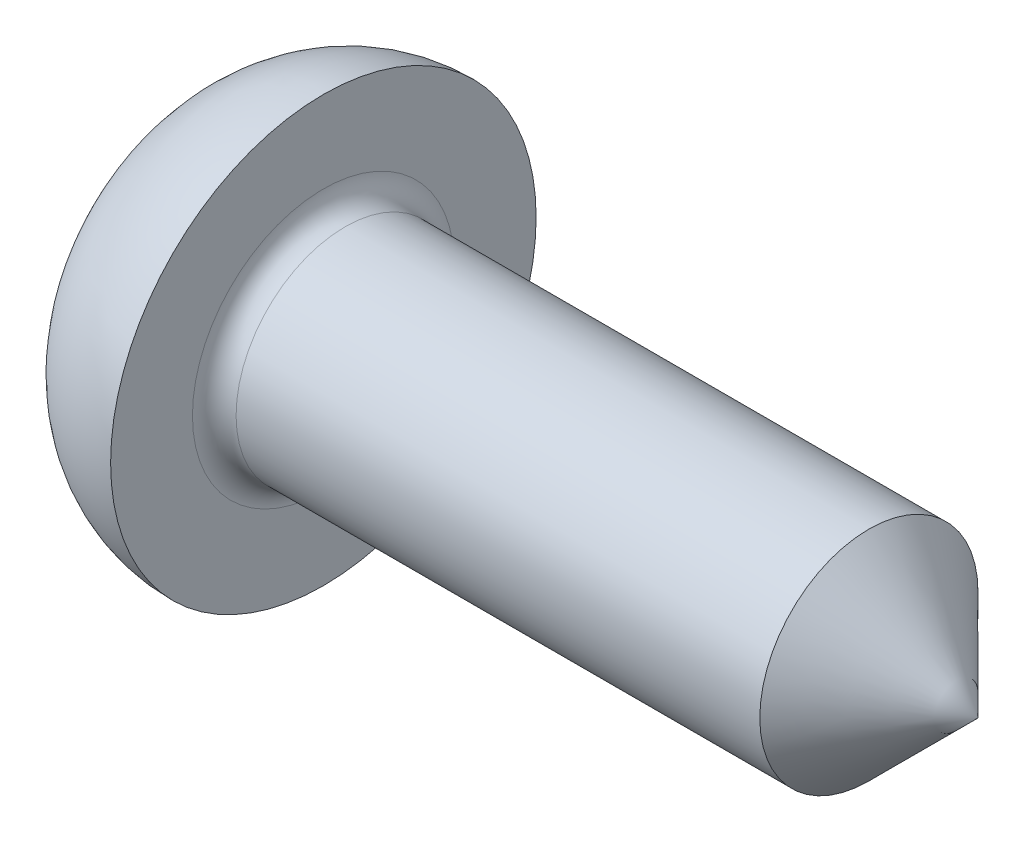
ISO-10303-21;
HEADER;
FILE_DESCRIPTION(('STEP AP214'),'2;1');
FILE_NAME('part.step','',(''),(''),'','','');
FILE_SCHEMA(('AUTOMOTIVE_DESIGN { 1 0 10303 214 1 1 1 1 }'));
ENDSEC;
DATA;
#1=APPLICATION_CONTEXT('core data for automotive mechanical design processes');
#2=APPLICATION_PROTOCOL_DEFINITION('international standard','automotive_design',2000,#1);
#3=PRODUCT_CONTEXT('',#1,'mechanical');
#4=PRODUCT('Part','Part','',(#3));
#5=PRODUCT_RELATED_PRODUCT_CATEGORY('part','',(#4));
#6=PRODUCT_DEFINITION_FORMATION('','',#4);
#7=PRODUCT_DEFINITION_CONTEXT('part definition',#1,'design');
#8=PRODUCT_DEFINITION('design','',#6,#7);
#9=PRODUCT_DEFINITION_SHAPE('','',#8);
#10=(LENGTH_UNIT() NAMED_UNIT(*) SI_UNIT(.MILLI.,.METRE.));
#11=(NAMED_UNIT(*) PLANE_ANGLE_UNIT() SI_UNIT($,.RADIAN.));
#12=(NAMED_UNIT(*) SI_UNIT($,.STERADIAN.) SOLID_ANGLE_UNIT());
#13=UNCERTAINTY_MEASURE_WITH_UNIT(LENGTH_MEASURE(1.E-05),#10,'distance_accuracy_value','');
#14=(GEOMETRIC_REPRESENTATION_CONTEXT(3) GLOBAL_UNCERTAINTY_ASSIGNED_CONTEXT((#13)) GLOBAL_UNIT_ASSIGNED_CONTEXT((#10,
#11,#12)) REPRESENTATION_CONTEXT('',''));
#15=CARTESIAN_POINT('',(0.,0.,0.));
#16=DIRECTION('',(0.,0.,1.));
#17=DIRECTION('',(1.,0.,0.));
#18=AXIS2_PLACEMENT_3D('',#15,#16,#17);
#19=CARTESIAN_POINT('',(-13.6292682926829,0.,0.));
#20=DIRECTION('',(-1.,0.,0.));
#21=DIRECTION('',(0.,0.,1.));
#22=AXIS2_PLACEMENT_3D('',#19,#20,#21);
#23=CYLINDRICAL_SURFACE('',#22,1.);
#24=CARTESIAN_POINT('',(1.8,0.,0.));
#25=DIRECTION('',(-1.,0.,0.));
#26=DIRECTION('',(0.,0.,1.));
#27=AXIS2_PLACEMENT_3D('',#24,#25,#26);
#28=CIRCLE('',#27,1.);
#29=CARTESIAN_POINT('',(1.8,0.,1.));
#30=VERTEX_POINT('',#29);
#31=EDGE_CURVE('E228',#30,#30,#28,.F.);
#32=ORIENTED_EDGE('',*,*,#31,.T.);
#33=EDGE_LOOP('',(#32));
#34=FACE_BOUND('',#33,.T.);
#35=CARTESIAN_POINT('',(6.6,0.,0.));
#36=DIRECTION('',(-1.,0.,0.));
#37=DIRECTION('',(0.,0.,1.));
#38=AXIS2_PLACEMENT_3D('',#35,#36,#37);
#39=CIRCLE('',#38,1.);
#40=CARTESIAN_POINT('',(6.6,0.,1.));
#41=VERTEX_POINT('',#40);
#42=EDGE_CURVE('E194',#41,#41,#39,.F.);
#43=ORIENTED_EDGE('',*,*,#42,.F.);
#44=EDGE_LOOP('',(#43));
#45=FACE_BOUND('',#44,.T.);
#46=ADVANCED_FACE('F54',(#34,#45),#23,.T.);
#47=CARTESIAN_POINT('',(2.3,0.,0.));
#48=DIRECTION('',(-1.,0.,0.));
#49=DIRECTION('',(0.,0.,-1.));
#50=AXIS2_PLACEMENT_3D('',#47,#48,#49);
#51=SPHERICAL_SURFACE('',#50,2.3);
#52=CARTESIAN_POINT('',(2.1589518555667,-0.208751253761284,0.));
#53=DIRECTION('',(0.559857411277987,0.82858896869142,0.));
#54=DIRECTION('',(-0.82858896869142,0.559857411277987,0.));
#55=AXIS2_PLACEMENT_3D('',#52,#53,#54);
#56=CIRCLE('',#55,2.28616017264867);
#57=CARTESIAN_POINT('',(0.27749446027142,1.06250374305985,-0.265625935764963));
#58=VERTEX_POINT('',#57);
#59=CARTESIAN_POINT('',(0.27749446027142,1.06250374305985,0.265625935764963));
#60=VERTEX_POINT('',#59);
#61=EDGE_CURVE('E179',#58,#60,#56,.T.);
#62=ORIENTED_EDGE('',*,*,#61,.T.);
#63=CARTESIAN_POINT('',(2.28751609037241,0.,-0.0739047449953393));
#64=DIRECTION('',(0.166559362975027,0.,0.986031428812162));
#65=DIRECTION('',(0.986031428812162,0.,-0.166559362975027));
#66=AXIS2_PLACEMENT_3D('',#63,#64,#65);
#67=CIRCLE('',#66,2.29877842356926);
#68=CARTESIAN_POINT('',(0.0409645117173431,0.305580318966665,0.305580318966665));
#69=VERTEX_POINT('',#68);
#70=EDGE_CURVE('E12',#60,#69,#67,.T.);
#71=ORIENTED_EDGE('',*,*,#70,.T.);
#72=CARTESIAN_POINT('',(2.28751609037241,-0.0739047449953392,0.));
#73=DIRECTION('',(0.166559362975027,0.986031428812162,0.));
#74=DIRECTION('',(-0.986031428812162,0.166559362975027,0.));
#75=AXIS2_PLACEMENT_3D('',#72,#73,#74);
#76=CIRCLE('',#75,2.29877842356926);
#77=CARTESIAN_POINT('',(0.27749446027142,0.265625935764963,1.06250374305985));
#78=VERTEX_POINT('',#77);
#79=EDGE_CURVE('E65',#69,#78,#76,.T.);
#80=ORIENTED_EDGE('',*,*,#79,.T.);
#81=CARTESIAN_POINT('',(2.1589518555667,0.,-0.208751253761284));
#82=DIRECTION('',(0.559857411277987,0.,0.82858896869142));
#83=DIRECTION('',(0.82858896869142,0.,-0.559857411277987));
#84=AXIS2_PLACEMENT_3D('',#81,#82,#83);
#85=CIRCLE('',#84,2.28616017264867);
#86=CARTESIAN_POINT('',(0.27749446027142,-0.265625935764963,1.06250374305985));
#87=VERTEX_POINT('',#86);
#88=EDGE_CURVE('E193',#78,#87,#85,.T.);
#89=ORIENTED_EDGE('',*,*,#88,.T.);
#90=CARTESIAN_POINT('',(2.28751609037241,0.0739047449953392,0.));
#91=DIRECTION('',(0.166559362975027,-0.986031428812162,0.));
#92=DIRECTION('',(0.986031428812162,0.166559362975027,0.));
#93=AXIS2_PLACEMENT_3D('',#90,#91,#92);
#94=CIRCLE('',#93,2.29877842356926);
#95=CARTESIAN_POINT('',(0.0409645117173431,-0.305580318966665,0.305580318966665));
#96=VERTEX_POINT('',#95);
#97=EDGE_CURVE('E112',#87,#96,#94,.T.);
#98=ORIENTED_EDGE('',*,*,#97,.T.);
#99=CARTESIAN_POINT('',(2.28751609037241,0.,-0.0739047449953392));
#100=DIRECTION('',(0.166559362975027,0.,0.986031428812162));
#101=DIRECTION('',(0.986031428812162,0.,-0.166559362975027));
#102=AXIS2_PLACEMENT_3D('',#99,#100,#101);
#103=CIRCLE('',#102,2.29877842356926);
#104=CARTESIAN_POINT('',(0.27749446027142,-1.06250374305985,0.265625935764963));
#105=VERTEX_POINT('',#104);
#106=EDGE_CURVE('E121',#96,#105,#103,.T.);
#107=ORIENTED_EDGE('',*,*,#106,.T.);
#108=CARTESIAN_POINT('',(2.1589518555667,0.208751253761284,0.));
#109=DIRECTION('',(0.559857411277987,-0.82858896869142,0.));
#110=DIRECTION('',(0.82858896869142,0.559857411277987,0.));
#111=AXIS2_PLACEMENT_3D('',#108,#109,#110);
#112=CIRCLE('',#111,2.28616017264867);
#113=CARTESIAN_POINT('',(0.27749446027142,-1.06250374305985,-0.265625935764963));
#114=VERTEX_POINT('',#113);
#115=EDGE_CURVE('E134',#105,#114,#112,.T.);
#116=ORIENTED_EDGE('',*,*,#115,.T.);
#117=CARTESIAN_POINT('',(2.28751609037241,0.,0.0739047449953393));
#118=DIRECTION('',(0.166559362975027,0.,-0.986031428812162));
#119=DIRECTION('',(-0.986031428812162,0.,-0.166559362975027));
#120=AXIS2_PLACEMENT_3D('',#117,#118,#119);
#121=CIRCLE('',#120,2.29877842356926);
#122=CARTESIAN_POINT('',(0.0409645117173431,-0.305580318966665,-0.305580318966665));
#123=VERTEX_POINT('',#122);
#124=EDGE_CURVE('E139',#114,#123,#121,.T.);
#125=ORIENTED_EDGE('',*,*,#124,.T.);
#126=CARTESIAN_POINT('',(2.28751609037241,0.0739047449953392,0.));
#127=DIRECTION('',(0.166559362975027,-0.986031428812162,0.));
#128=DIRECTION('',(0.986031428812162,0.166559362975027,0.));
#129=AXIS2_PLACEMENT_3D('',#126,#127,#128);
#130=CIRCLE('',#129,2.29877842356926);
#131=CARTESIAN_POINT('',(0.27749446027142,-0.265625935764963,-1.06250374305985));
#132=VERTEX_POINT('',#131);
#133=EDGE_CURVE('E150',#123,#132,#130,.T.);
#134=ORIENTED_EDGE('',*,*,#133,.T.);
#135=CARTESIAN_POINT('',(2.1589518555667,0.,0.208751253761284));
#136=DIRECTION('',(0.559857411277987,0.,-0.82858896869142));
#137=DIRECTION('',(-0.82858896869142,0.,-0.559857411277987));
#138=AXIS2_PLACEMENT_3D('',#135,#136,#137);
#139=CIRCLE('',#138,2.28616017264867);
#140=CARTESIAN_POINT('',(0.27749446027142,0.265625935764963,-1.06250374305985));
#141=VERTEX_POINT('',#140);
#142=EDGE_CURVE('E156',#132,#141,#139,.T.);
#143=ORIENTED_EDGE('',*,*,#142,.T.);
#144=CARTESIAN_POINT('',(2.28751609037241,-0.0739047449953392,0.));
#145=DIRECTION('',(0.166559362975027,0.986031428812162,0.));
#146=DIRECTION('',(-0.986031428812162,0.166559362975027,0.));
#147=AXIS2_PLACEMENT_3D('',#144,#145,#146);
#148=CIRCLE('',#147,2.29877842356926);
#149=CARTESIAN_POINT('',(0.0409645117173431,0.305580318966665,-0.305580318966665));
#150=VERTEX_POINT('',#149);
#151=EDGE_CURVE('E165',#141,#150,#148,.T.);
#152=ORIENTED_EDGE('',*,*,#151,.T.);
#153=CARTESIAN_POINT('',(2.28751609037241,0.,0.0739047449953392));
#154=DIRECTION('',(0.166559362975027,0.,-0.986031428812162));
#155=DIRECTION('',(-0.986031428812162,0.,-0.166559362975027));
#156=AXIS2_PLACEMENT_3D('',#153,#154,#155);
#157=CIRCLE('',#156,2.29877842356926);
#158=EDGE_CURVE('E175',#150,#58,#157,.T.);
#159=ORIENTED_EDGE('',*,*,#158,.T.);
#160=EDGE_LOOP('',(#62,#71,#80,#89,#98,#107,#116,#125,#134,#143,#152,#159));
#161=FACE_BOUND('',#160,.T.);
#162=CARTESIAN_POINT('',(0.479554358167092,0.,0.));
#163=DIRECTION('',(-1.,0.,0.));
#164=DIRECTION('',(0.,0.,1.));
#165=AXIS2_PLACEMENT_3D('',#162,#163,#164);
#166=CIRCLE('',#165,1.4056947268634);
#167=CARTESIAN_POINT('',(0.479554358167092,0.,1.4056947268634));
#168=VERTEX_POINT('',#167);
#169=EDGE_CURVE('E218',#168,#168,#166,.T.);
#170=ORIENTED_EDGE('',*,*,#169,.T.);
#171=EDGE_LOOP('',(#170));
#172=FACE_BOUND('',#171,.T.);
#173=ADVANCED_FACE('F241',(#161,#172),#51,.T.);
#174=CARTESIAN_POINT('',(1.58765170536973,0.,0.));
#175=DIRECTION('',(-1.,0.,0.));
#176=DIRECTION('',(0.,0.,1.));
#177=AXIS2_PLACEMENT_3D('',#174,#175,#176);
#178=DEGENERATE_TOROIDAL_SURFACE('',#177,0.550054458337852,1.4,.T.);
#179=ORIENTED_EDGE('',*,*,#169,.F.);
#180=EDGE_LOOP('',(#179));
#181=FACE_BOUND('',#180,.T.);
#182=CARTESIAN_POINT('',(1.6,0.,0.));
#183=DIRECTION('',(-1.,0.,0.));
#184=DIRECTION('',(0.,0.,1.));
#185=AXIS2_PLACEMENT_3D('',#182,#183,#184);
#186=CIRCLE('',#185,1.95);
#187=CARTESIAN_POINT('',(1.6,0.,1.95));
#188=VERTEX_POINT('',#187);
#189=EDGE_CURVE('E217',#188,#188,#186,.T.);
#190=ORIENTED_EDGE('',*,*,#189,.T.);
#191=EDGE_LOOP('',(#190));
#192=FACE_BOUND('',#191,.T.);
#193=ADVANCED_FACE('F242',(#181,#192),#178,.T.);
#194=CARTESIAN_POINT('',(1.6,0.,-1.));
#195=DIRECTION('',(-1.,0.,0.));
#196=DIRECTION('',(0.,0.,1.));
#197=AXIS2_PLACEMENT_3D('',#194,#195,#196);
#198=PLANE('',#197);
#199=CARTESIAN_POINT('',(1.6,0.,0.));
#200=DIRECTION('',(-1.,0.,0.));
#201=DIRECTION('',(0.,0.,1.));
#202=AXIS2_PLACEMENT_3D('',#199,#200,#201);
#203=CIRCLE('',#202,1.2);
#204=CARTESIAN_POINT('',(1.6,0.,1.2));
#205=VERTEX_POINT('',#204);
#206=EDGE_CURVE('E223',#205,#205,#203,.T.);
#207=ORIENTED_EDGE('',*,*,#206,.T.);
#208=EDGE_LOOP('',(#207));
#209=FACE_BOUND('',#208,.T.);
#210=ORIENTED_EDGE('',*,*,#189,.F.);
#211=EDGE_LOOP('',(#210));
#212=FACE_BOUND('',#211,.T.);
#213=ADVANCED_FACE('F248',(#209,#212),#198,.F.);
#214=CARTESIAN_POINT('',(1.8,0.,0.));
#215=DIRECTION('',(-1.,0.,0.));
#216=DIRECTION('',(0.,0.,1.));
#217=AXIS2_PLACEMENT_3D('',#214,#215,#216);
#218=TOROIDAL_SURFACE('',#217,1.2,0.2);
#219=ORIENTED_EDGE('',*,*,#31,.F.);
#220=EDGE_LOOP('',(#219));
#221=FACE_BOUND('',#220,.T.);
#222=ORIENTED_EDGE('',*,*,#206,.F.);
#223=EDGE_LOOP('',(#222));
#224=FACE_BOUND('',#223,.T.);
#225=ADVANCED_FACE('F60',(#221,#224),#218,.F.);
#226=CARTESIAN_POINT('',(-13.3999999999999,0.,0.));
#227=DIRECTION('',(-1.,0.,0.));
#228=DIRECTION('',(0.,0.,1.));
#229=AXIS2_PLACEMENT_3D('',#226,#227,#228);
#230=CONICAL_SURFACE('',#229,21.,0.78539816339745);
#231=CARTESIAN_POINT('',(7.6,0.,0.));
#232=VERTEX_POINT('',#231);
#233=VERTEX_LOOP('',#232);
#234=FACE_BOUND('',#233,.T.);
#235=ORIENTED_EDGE('',*,*,#42,.T.);
#236=EDGE_LOOP('',(#235));
#237=FACE_BOUND('',#236,.T.);
#238=ADVANCED_FACE('F256',(#234,#237),#230,.T.);
#239=CARTESIAN_POINT('',(0.,1.25,0.3125));
#240=DIRECTION('',(0.166559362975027,0.,0.986031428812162));
#241=DIRECTION('',(0.986031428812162,0.,-0.166559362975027));
#242=AXIS2_PLACEMENT_3D('',#239,#240,#241);
#243=PLANE('',#242);
#244=DIRECTION('',(-0.820590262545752,0.554452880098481,0.13861322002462));
#245=VECTOR('',#244,1.);
#246=CARTESIAN_POINT('',(1.85,0.,0.));
#247=LINE('',#246,#245);
#248=CARTESIAN_POINT('',(1.85,0.,0.));
#249=VERTEX_POINT('',#248);
#250=EDGE_CURVE('E178',#249,#60,#247,.T.);
#251=ORIENTED_EDGE('',*,*,#250,.F.);
#252=DIRECTION('',(-0.97263232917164,0.164296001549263,0.164296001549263));
#253=VECTOR('',#252,1.);
#254=CARTESIAN_POINT('',(1.85,0.,0.));
#255=LINE('',#254,#253);
#256=EDGE_CURVE('E187',#249,#69,#255,.T.);
#257=ORIENTED_EDGE('',*,*,#256,.T.);
#258=ORIENTED_EDGE('',*,*,#70,.F.);
#259=EDGE_LOOP('',(#251,#257,#258));
#260=FACE_BOUND('',#259,.T.);
#261=ADVANCED_FACE('F184',(#260),#243,.F.);
#262=CARTESIAN_POINT('',(0.,0.3125,0.3125));
#263=DIRECTION('',(0.166559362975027,0.986031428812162,0.));
#264=DIRECTION('',(-0.986031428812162,0.166559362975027,0.));
#265=AXIS2_PLACEMENT_3D('',#262,#263,#264);
#266=PLANE('',#265);
#267=ORIENTED_EDGE('',*,*,#256,.F.);
#268=DIRECTION('',(-0.820590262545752,0.13861322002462,0.554452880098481));
#269=VECTOR('',#268,1.);
#270=CARTESIAN_POINT('',(1.85,0.,0.));
#271=LINE('',#270,#269);
#272=EDGE_CURVE('E116',#249,#78,#271,.T.);
#273=ORIENTED_EDGE('',*,*,#272,.T.);
#274=ORIENTED_EDGE('',*,*,#79,.F.);
#275=EDGE_LOOP('',(#267,#273,#274));
#276=FACE_BOUND('',#275,.T.);
#277=ADVANCED_FACE('F188',(#276),#266,.F.);
#278=CARTESIAN_POINT('',(0.,1.25,-0.3125));
#279=DIRECTION('',(0.559857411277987,0.82858896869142,0.));
#280=DIRECTION('',(-0.82858896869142,0.559857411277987,0.));
#281=AXIS2_PLACEMENT_3D('',#278,#279,#280);
#282=PLANE('',#281);
#283=DIRECTION('',(-0.820590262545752,0.554452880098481,-0.13861322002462));
#284=VECTOR('',#283,1.);
#285=CARTESIAN_POINT('',(1.85,0.,0.));
#286=LINE('',#285,#284);
#287=EDGE_CURVE('E167',#249,#58,#286,.T.);
#288=ORIENTED_EDGE('',*,*,#287,.F.);
#289=ORIENTED_EDGE('',*,*,#250,.T.);
#290=ORIENTED_EDGE('',*,*,#61,.F.);
#291=EDGE_LOOP('',(#288,#289,#290));
#292=FACE_BOUND('',#291,.T.);
#293=ADVANCED_FACE('F180',(#292),#282,.F.);
#294=CARTESIAN_POINT('',(0.,0.3125,-0.3125));
#295=DIRECTION('',(0.166559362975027,0.,-0.986031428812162));
#296=DIRECTION('',(-0.986031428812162,0.,-0.166559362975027));
#297=AXIS2_PLACEMENT_3D('',#294,#295,#296);
#298=PLANE('',#297);
#299=DIRECTION('',(-0.97263232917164,0.164296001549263,-0.164296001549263));
#300=VECTOR('',#299,1.);
#301=CARTESIAN_POINT('',(1.85,0.,0.));
#302=LINE('',#301,#300);
#303=EDGE_CURVE('E162',#249,#150,#302,.T.);
#304=ORIENTED_EDGE('',*,*,#303,.F.);
#305=ORIENTED_EDGE('',*,*,#287,.T.);
#306=ORIENTED_EDGE('',*,*,#158,.F.);
#307=EDGE_LOOP('',(#304,#305,#306));
#308=FACE_BOUND('',#307,.T.);
#309=ADVANCED_FACE('F169',(#308),#298,.F.);
#310=CARTESIAN_POINT('',(0.,0.3125,-1.25));
#311=DIRECTION('',(0.166559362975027,0.986031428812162,0.));
#312=DIRECTION('',(-0.986031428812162,0.166559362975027,0.));
#313=AXIS2_PLACEMENT_3D('',#310,#311,#312);
#314=PLANE('',#313);
#315=DIRECTION('',(-0.820590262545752,0.13861322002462,-0.554452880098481));
#316=VECTOR('',#315,1.);
#317=CARTESIAN_POINT('',(1.85,0.,0.));
#318=LINE('',#317,#316);
#319=EDGE_CURVE('E151',#249,#141,#318,.T.);
#320=ORIENTED_EDGE('',*,*,#319,.F.);
#321=ORIENTED_EDGE('',*,*,#303,.T.);
#322=ORIENTED_EDGE('',*,*,#151,.F.);
#323=EDGE_LOOP('',(#320,#321,#322));
#324=FACE_BOUND('',#323,.T.);
#325=ADVANCED_FACE('F163',(#324),#314,.F.);
#326=CARTESIAN_POINT('',(0.,-0.3125,-1.25));
#327=DIRECTION('',(0.559857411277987,0.,-0.82858896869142));
#328=DIRECTION('',(-0.82858896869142,0.,-0.559857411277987));
#329=AXIS2_PLACEMENT_3D('',#326,#327,#328);
#330=PLANE('',#329);
#331=DIRECTION('',(-0.820590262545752,-0.13861322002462,-0.554452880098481));
#332=VECTOR('',#331,1.);
#333=CARTESIAN_POINT('',(1.85,0.,0.));
#334=LINE('',#333,#332);
#335=EDGE_CURVE('E147',#249,#132,#334,.T.);
#336=ORIENTED_EDGE('',*,*,#335,.F.);
#337=ORIENTED_EDGE('',*,*,#319,.T.);
#338=ORIENTED_EDGE('',*,*,#142,.F.);
#339=EDGE_LOOP('',(#336,#337,#338));
#340=FACE_BOUND('',#339,.T.);
#341=ADVANCED_FACE('F155',(#340),#330,.F.);
#342=CARTESIAN_POINT('',(0.,-0.3125,-0.3125));
#343=DIRECTION('',(0.166559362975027,-0.986031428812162,0.));
#344=DIRECTION('',(0.986031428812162,0.166559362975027,0.));
#345=AXIS2_PLACEMENT_3D('',#342,#343,#344);
#346=PLANE('',#345);
#347=DIRECTION('',(-0.97263232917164,-0.164296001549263,-0.164296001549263));
#348=VECTOR('',#347,1.);
#349=CARTESIAN_POINT('',(1.85,0.,0.));
#350=LINE('',#349,#348);
#351=EDGE_CURVE('E138',#249,#123,#350,.T.);
#352=ORIENTED_EDGE('',*,*,#351,.F.);
#353=ORIENTED_EDGE('',*,*,#335,.T.);
#354=ORIENTED_EDGE('',*,*,#133,.F.);
#355=EDGE_LOOP('',(#352,#353,#354));
#356=FACE_BOUND('',#355,.T.);
#357=ADVANCED_FACE('F143',(#356),#346,.F.);
#358=CARTESIAN_POINT('',(0.,-1.25,-0.3125));
#359=DIRECTION('',(0.166559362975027,0.,-0.986031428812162));
#360=DIRECTION('',(-0.986031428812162,0.,-0.166559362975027));
#361=AXIS2_PLACEMENT_3D('',#358,#359,#360);
#362=PLANE('',#361);
#363=DIRECTION('',(-0.820590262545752,-0.554452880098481,-0.13861322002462));
#364=VECTOR('',#363,1.);
#365=CARTESIAN_POINT('',(1.85,0.,0.));
#366=LINE('',#365,#364);
#367=EDGE_CURVE('E128',#249,#114,#366,.T.);
#368=ORIENTED_EDGE('',*,*,#367,.F.);
#369=ORIENTED_EDGE('',*,*,#351,.T.);
#370=ORIENTED_EDGE('',*,*,#124,.F.);
#371=EDGE_LOOP('',(#368,#369,#370));
#372=FACE_BOUND('',#371,.T.);
#373=ADVANCED_FACE('F140',(#372),#362,.F.);
#374=CARTESIAN_POINT('',(0.,-1.25,0.3125));
#375=DIRECTION('',(0.559857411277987,-0.82858896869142,0.));
#376=DIRECTION('',(0.82858896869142,0.559857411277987,0.));
#377=AXIS2_PLACEMENT_3D('',#374,#375,#376);
#378=PLANE('',#377);
#379=DIRECTION('',(-0.820590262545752,-0.554452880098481,0.13861322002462));
#380=VECTOR('',#379,1.);
#381=CARTESIAN_POINT('',(1.85,0.,0.));
#382=LINE('',#381,#380);
#383=EDGE_CURVE('E125',#249,#105,#382,.T.);
#384=ORIENTED_EDGE('',*,*,#383,.F.);
#385=ORIENTED_EDGE('',*,*,#367,.T.);
#386=ORIENTED_EDGE('',*,*,#115,.F.);
#387=EDGE_LOOP('',(#384,#385,#386));
#388=FACE_BOUND('',#387,.T.);
#389=ADVANCED_FACE('F126',(#388),#378,.F.);
#390=CARTESIAN_POINT('',(0.,-0.3125,0.3125));
#391=DIRECTION('',(0.166559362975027,0.,0.986031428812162));
#392=DIRECTION('',(0.986031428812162,0.,-0.166559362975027));
#393=AXIS2_PLACEMENT_3D('',#390,#391,#392);
#394=PLANE('',#393);
#395=DIRECTION('',(-0.97263232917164,-0.164296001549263,0.164296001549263));
#396=VECTOR('',#395,1.);
#397=CARTESIAN_POINT('',(1.85,0.,0.));
#398=LINE('',#397,#396);
#399=EDGE_CURVE('E115',#249,#96,#398,.T.);
#400=ORIENTED_EDGE('',*,*,#399,.F.);
#401=ORIENTED_EDGE('',*,*,#383,.T.);
#402=ORIENTED_EDGE('',*,*,#106,.F.);
#403=EDGE_LOOP('',(#400,#401,#402));
#404=FACE_BOUND('',#403,.T.);
#405=ADVANCED_FACE('F122',(#404),#394,.F.);
#406=CARTESIAN_POINT('',(0.,-0.3125,1.25));
#407=DIRECTION('',(0.166559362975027,-0.986031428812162,0.));
#408=DIRECTION('',(0.986031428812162,0.166559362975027,0.));
#409=AXIS2_PLACEMENT_3D('',#406,#407,#408);
#410=PLANE('',#409);
#411=DIRECTION('',(-0.820590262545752,-0.13861322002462,0.554452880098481));
#412=VECTOR('',#411,1.);
#413=CARTESIAN_POINT('',(1.85,0.,0.));
#414=LINE('',#413,#412);
#415=EDGE_CURVE('E68',#249,#87,#414,.T.);
#416=ORIENTED_EDGE('',*,*,#415,.F.);
#417=ORIENTED_EDGE('',*,*,#399,.T.);
#418=ORIENTED_EDGE('',*,*,#97,.F.);
#419=EDGE_LOOP('',(#416,#417,#418));
#420=FACE_BOUND('',#419,.T.);
#421=ADVANCED_FACE('F111',(#420),#410,.F.);
#422=CARTESIAN_POINT('',(0.,0.3125,1.25));
#423=DIRECTION('',(0.559857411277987,0.,0.82858896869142));
#424=DIRECTION('',(0.82858896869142,0.,-0.559857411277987));
#425=AXIS2_PLACEMENT_3D('',#422,#423,#424);
#426=PLANE('',#425);
#427=ORIENTED_EDGE('',*,*,#272,.F.);
#428=ORIENTED_EDGE('',*,*,#415,.T.);
#429=ORIENTED_EDGE('',*,*,#88,.F.);
#430=EDGE_LOOP('',(#427,#428,#429));
#431=FACE_BOUND('',#430,.T.);
#432=ADVANCED_FACE('F191',(#431),#426,.F.);
#433=CLOSED_SHELL('',(#46,#173,#193,#213,#225,#238,#261,#277,#293,#309,#325,#341,#357,#373,#389,
#405,#421,#432));
#434=MANIFOLD_SOLID_BREP('B2',#433);
#435=ADVANCED_BREP_SHAPE_REPRESENTATION('',(#18,#434),#14);
#436=SHAPE_DEFINITION_REPRESENTATION(#9,#435);
ENDSEC;
END-ISO-10303-21;
